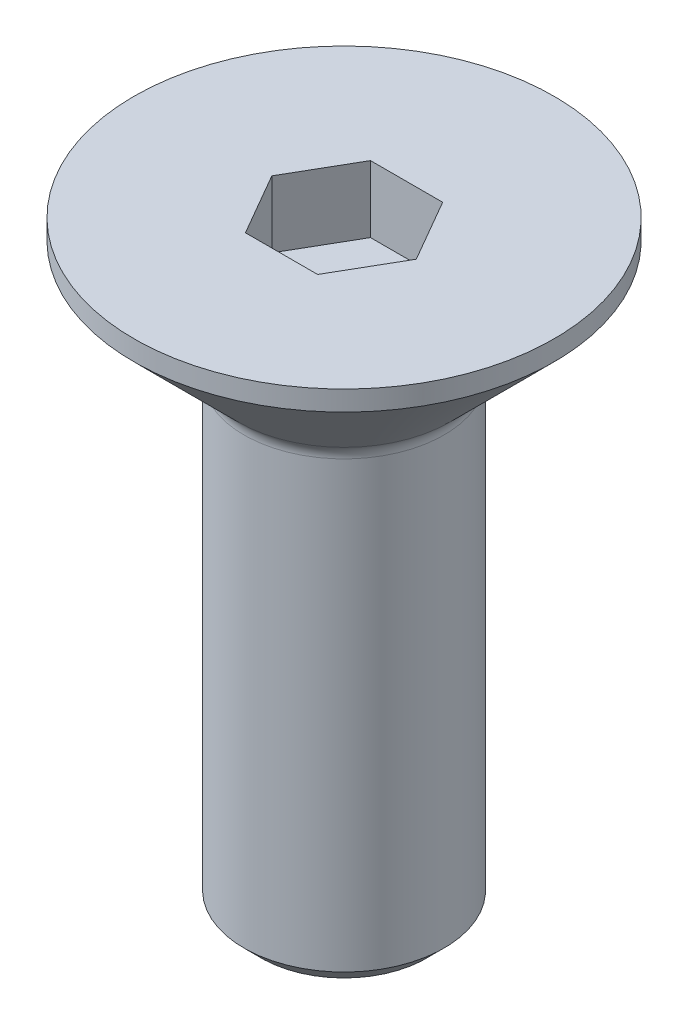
ISO-10303-21;
HEADER;
FILE_DESCRIPTION(('STEP AP214'),'2;1');
FILE_NAME('part.step','',(''),(''),'','','');
FILE_SCHEMA(('AUTOMOTIVE_DESIGN { 1 0 10303 214 1 1 1 1 }'));
ENDSEC;
DATA;
#1=APPLICATION_CONTEXT('core data for automotive mechanical design processes');
#2=APPLICATION_PROTOCOL_DEFINITION('international standard','automotive_design',2000,#1);
#3=PRODUCT_CONTEXT('',#1,'mechanical');
#4=PRODUCT('Part','Part','',(#3));
#5=PRODUCT_RELATED_PRODUCT_CATEGORY('part','',(#4));
#6=PRODUCT_DEFINITION_FORMATION('','',#4);
#7=PRODUCT_DEFINITION_CONTEXT('part definition',#1,'design');
#8=PRODUCT_DEFINITION('design','',#6,#7);
#9=PRODUCT_DEFINITION_SHAPE('','',#8);
#10=(LENGTH_UNIT() NAMED_UNIT(*) SI_UNIT(.MILLI.,.METRE.));
#11=(NAMED_UNIT(*) PLANE_ANGLE_UNIT() SI_UNIT($,.RADIAN.));
#12=(NAMED_UNIT(*) SI_UNIT($,.STERADIAN.) SOLID_ANGLE_UNIT());
#13=UNCERTAINTY_MEASURE_WITH_UNIT(LENGTH_MEASURE(1.E-05),#10,'distance_accuracy_value','');
#14=(GEOMETRIC_REPRESENTATION_CONTEXT(3) GLOBAL_UNCERTAINTY_ASSIGNED_CONTEXT((#13)) GLOBAL_UNIT_ASSIGNED_CONTEXT((#10,
#11,#12)) REPRESENTATION_CONTEXT('',''));
#15=CARTESIAN_POINT('',(0.,0.,0.));
#16=DIRECTION('',(0.,0.,1.));
#17=DIRECTION('',(1.,0.,0.));
#18=AXIS2_PLACEMENT_3D('',#15,#16,#17);
#19=CARTESIAN_POINT('',(0.,-2.76568542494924,0.));
#20=DIRECTION('',(0.,1.,0.));
#21=DIRECTION('',(-1.,0.,0.));
#22=AXIS2_PLACEMENT_3D('',#19,#20,#21);
#23=TOROIDAL_SURFACE('',#22,2.4,0.400000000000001);
#24=CARTESIAN_POINT('',(0.,-2.48284271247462,0.));
#25=DIRECTION('',(0.,1.,0.));
#26=DIRECTION('',(-1.,0.,0.));
#27=AXIS2_PLACEMENT_3D('',#24,#25,#26);
#28=CIRCLE('',#27,2.11715728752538);
#29=CARTESIAN_POINT('',(-2.11715728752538,-2.48284271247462,0.));
#30=VERTEX_POINT('',#29);
#31=EDGE_CURVE('E11',#30,#30,#28,.T.);
#32=ORIENTED_EDGE('',*,*,#31,.F.);
#33=EDGE_LOOP('',(#32));
#34=FACE_BOUND('',#33,.T.);
#35=CARTESIAN_POINT('',(0.,-2.76568542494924,0.));
#36=DIRECTION('',(0.,1.,0.));
#37=DIRECTION('',(-1.,0.,0.));
#38=AXIS2_PLACEMENT_3D('',#35,#36,#37);
#39=CIRCLE('',#38,2.);
#40=CARTESIAN_POINT('',(-2.,-2.76568542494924,0.));
#41=VERTEX_POINT('',#40);
#42=EDGE_CURVE('E135',#41,#41,#39,.T.);
#43=ORIENTED_EDGE('',*,*,#42,.T.);
#44=EDGE_LOOP('',(#43));
#45=FACE_BOUND('',#44,.T.);
#46=ADVANCED_FACE('F34',(#34,#45),#23,.F.);
#47=CARTESIAN_POINT('',(0.,-2.48284271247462,0.));
#48=DIRECTION('',(0.,1.,0.));
#49=DIRECTION('',(-1.,0.,0.));
#50=AXIS2_PLACEMENT_3D('',#47,#48,#49);
#51=CONICAL_SURFACE('',#50,2.11715728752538,0.78539816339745);
#52=CARTESIAN_POINT('',(0.,-0.400000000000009,0.));
#53=DIRECTION('',(0.,1.,0.));
#54=DIRECTION('',(-1.,0.,0.));
#55=AXIS2_PLACEMENT_3D('',#52,#53,#54);
#56=CIRCLE('',#55,4.2);
#57=CARTESIAN_POINT('',(-4.2,-0.400000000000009,0.));
#58=VERTEX_POINT('',#57);
#59=EDGE_CURVE('E41',#58,#58,#56,.T.);
#60=ORIENTED_EDGE('',*,*,#59,.F.);
#61=EDGE_LOOP('',(#60));
#62=FACE_BOUND('',#61,.T.);
#63=ORIENTED_EDGE('',*,*,#31,.T.);
#64=EDGE_LOOP('',(#63));
#65=FACE_BOUND('',#64,.T.);
#66=ADVANCED_FACE('F156',(#62,#65),#51,.T.);
#67=CARTESIAN_POINT('',(0.,0.,0.));
#68=DIRECTION('',(0.,1.,0.));
#69=DIRECTION('',(-1.,0.,0.));
#70=AXIS2_PLACEMENT_3D('',#67,#68,#69);
#71=CYLINDRICAL_SURFACE('',#70,4.2);
#72=CARTESIAN_POINT('',(0.,0.,0.));
#73=DIRECTION('',(0.,1.,0.));
#74=DIRECTION('',(-1.,0.,0.));
#75=AXIS2_PLACEMENT_3D('',#72,#73,#74);
#76=CIRCLE('',#75,4.2);
#77=CARTESIAN_POINT('',(-4.2,0.,0.));
#78=VERTEX_POINT('',#77);
#79=EDGE_CURVE('E149',#78,#78,#76,.T.);
#80=ORIENTED_EDGE('',*,*,#79,.F.);
#81=EDGE_LOOP('',(#80));
#82=FACE_BOUND('',#81,.T.);
#83=ORIENTED_EDGE('',*,*,#59,.T.);
#84=EDGE_LOOP('',(#83));
#85=FACE_BOUND('',#84,.T.);
#86=ADVANCED_FACE('F154',(#82,#85),#71,.T.);
#87=CARTESIAN_POINT('',(4.2,0.,0.));
#88=DIRECTION('',(0.,-1.,0.));
#89=DIRECTION('',(1.,0.,0.));
#90=AXIS2_PLACEMENT_3D('',#87,#88,#89);
#91=PLANE('',#90);
#92=DIRECTION('',(-0.5,0.,-0.866025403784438));
#93=VECTOR('',#92,1.);
#94=CARTESIAN_POINT('',(1.44337567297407,0.,0.));
#95=LINE('',#94,#93);
#96=CARTESIAN_POINT('',(1.44337567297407,0.,0.));
#97=VERTEX_POINT('',#96);
#98=CARTESIAN_POINT('',(0.721687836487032,0.,-1.25));
#99=VERTEX_POINT('',#98);
#100=EDGE_CURVE('E122',#97,#99,#95,.T.);
#101=ORIENTED_EDGE('',*,*,#100,.F.);
#102=DIRECTION('',(0.5,0.,-0.866025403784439));
#103=VECTOR('',#102,1.);
#104=CARTESIAN_POINT('',(0.721687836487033,0.,1.25));
#105=LINE('',#104,#103);
#106=CARTESIAN_POINT('',(0.721687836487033,0.,1.25));
#107=VERTEX_POINT('',#106);
#108=EDGE_CURVE('E48',#107,#97,#105,.T.);
#109=ORIENTED_EDGE('',*,*,#108,.F.);
#110=DIRECTION('',(1.,0.,0.));
#111=VECTOR('',#110,1.);
#112=CARTESIAN_POINT('',(-0.721687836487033,0.,1.25));
#113=LINE('',#112,#111);
#114=CARTESIAN_POINT('',(-0.721687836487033,0.,1.25));
#115=VERTEX_POINT('',#114);
#116=EDGE_CURVE('E131',#115,#107,#113,.T.);
#117=ORIENTED_EDGE('',*,*,#116,.F.);
#118=DIRECTION('',(0.5,0.,0.866025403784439));
#119=VECTOR('',#118,1.);
#120=CARTESIAN_POINT('',(-1.44337567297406,0.,0.));
#121=LINE('',#120,#119);
#122=CARTESIAN_POINT('',(-1.44337567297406,0.,0.));
#123=VERTEX_POINT('',#122);
#124=EDGE_CURVE('E129',#123,#115,#121,.T.);
#125=ORIENTED_EDGE('',*,*,#124,.F.);
#126=DIRECTION('',(-0.5,0.,0.866025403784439));
#127=VECTOR('',#126,1.);
#128=CARTESIAN_POINT('',(-0.721687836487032,0.,-1.25));
#129=LINE('',#128,#127);
#130=CARTESIAN_POINT('',(-0.721687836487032,0.,-1.25));
#131=VERTEX_POINT('',#130);
#132=EDGE_CURVE('E96',#131,#123,#129,.T.);
#133=ORIENTED_EDGE('',*,*,#132,.F.);
#134=DIRECTION('',(-1.,0.,0.));
#135=VECTOR('',#134,1.);
#136=CARTESIAN_POINT('',(0.721687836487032,0.,-1.25));
#137=LINE('',#136,#135);
#138=EDGE_CURVE('E125',#99,#131,#137,.T.);
#139=ORIENTED_EDGE('',*,*,#138,.F.);
#140=EDGE_LOOP('',(#101,#109,#117,#125,#133,#139));
#141=FACE_BOUND('',#140,.T.);
#142=ORIENTED_EDGE('',*,*,#79,.T.);
#143=EDGE_LOOP('',(#142));
#144=FACE_BOUND('',#143,.T.);
#145=ADVANCED_FACE('F180',(#141,#144),#91,.F.);
#146=CARTESIAN_POINT('',(1.65,-12.,0.));
#147=DIRECTION('',(0.,1.,0.));
#148=DIRECTION('',(-1.,0.,0.));
#149=AXIS2_PLACEMENT_3D('',#146,#147,#148);
#150=PLANE('',#149);
#151=CARTESIAN_POINT('',(0.,-12.,0.));
#152=DIRECTION('',(0.,1.,0.));
#153=DIRECTION('',(-1.,0.,0.));
#154=AXIS2_PLACEMENT_3D('',#151,#152,#153);
#155=CIRCLE('',#154,1.65);
#156=CARTESIAN_POINT('',(-1.65,-12.,0.));
#157=VERTEX_POINT('',#156);
#158=EDGE_CURVE('E146',#157,#157,#155,.T.);
#159=ORIENTED_EDGE('',*,*,#158,.F.);
#160=EDGE_LOOP('',(#159));
#161=FACE_BOUND('',#160,.T.);
#162=ADVANCED_FACE('F175',(#161),#150,.F.);
#163=CARTESIAN_POINT('',(0.,-12.,0.));
#164=DIRECTION('',(0.,1.,0.));
#165=DIRECTION('',(-1.,0.,0.));
#166=AXIS2_PLACEMENT_3D('',#163,#164,#165);
#167=CONICAL_SURFACE('',#166,1.65,0.785398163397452);
#168=CARTESIAN_POINT('',(0.,-11.65,0.));
#169=DIRECTION('',(0.,1.,0.));
#170=DIRECTION('',(-1.,0.,0.));
#171=AXIS2_PLACEMENT_3D('',#168,#169,#170);
#172=CIRCLE('',#171,2.);
#173=CARTESIAN_POINT('',(-2.,-11.65,0.));
#174=VERTEX_POINT('',#173);
#175=EDGE_CURVE('E143',#174,#174,#172,.T.);
#176=ORIENTED_EDGE('',*,*,#175,.F.);
#177=EDGE_LOOP('',(#176));
#178=FACE_BOUND('',#177,.T.);
#179=ORIENTED_EDGE('',*,*,#158,.T.);
#180=EDGE_LOOP('',(#179));
#181=FACE_BOUND('',#180,.T.);
#182=ADVANCED_FACE('F169',(#178,#181),#167,.T.);
#183=CARTESIAN_POINT('',(0.,0.,0.));
#184=DIRECTION('',(0.,1.,0.));
#185=DIRECTION('',(-1.,0.,0.));
#186=AXIS2_PLACEMENT_3D('',#183,#184,#185);
#187=CYLINDRICAL_SURFACE('',#186,2.);
#188=ORIENTED_EDGE('',*,*,#42,.F.);
#189=EDGE_LOOP('',(#188));
#190=FACE_BOUND('',#189,.T.);
#191=ORIENTED_EDGE('',*,*,#175,.T.);
#192=EDGE_LOOP('',(#191));
#193=FACE_BOUND('',#192,.T.);
#194=ADVANCED_FACE('F165',(#190,#193),#187,.T.);
#195=CARTESIAN_POINT('',(0.721687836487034,-1.33333333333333,1.25));
#196=DIRECTION('',(0.866025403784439,0.,0.5));
#197=DIRECTION('',(0.5,0.,-0.866025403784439));
#198=AXIS2_PLACEMENT_3D('',#195,#196,#197);
#199=PLANE('',#198);
#200=ORIENTED_EDGE('',*,*,#108,.T.);
#201=DIRECTION('',(0.,1.,0.));
#202=VECTOR('',#201,1.);
#203=CARTESIAN_POINT('',(1.44337567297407,-1.33333333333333,0.));
#204=LINE('',#203,#202);
#205=CARTESIAN_POINT('',(1.44337567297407,-1.33333333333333,0.));
#206=VERTEX_POINT('',#205);
#207=EDGE_CURVE('E78',#206,#97,#204,.T.);
#208=ORIENTED_EDGE('',*,*,#207,.F.);
#209=DIRECTION('',(0.5,0.,-0.866025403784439));
#210=VECTOR('',#209,1.);
#211=CARTESIAN_POINT('',(0.721687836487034,-1.33333333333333,1.25));
#212=LINE('',#211,#210);
#213=CARTESIAN_POINT('',(0.721687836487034,-1.33333333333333,1.25));
#214=VERTEX_POINT('',#213);
#215=EDGE_CURVE('E133',#214,#206,#212,.T.);
#216=ORIENTED_EDGE('',*,*,#215,.F.);
#217=DIRECTION('',(0.,1.,0.));
#218=VECTOR('',#217,1.);
#219=CARTESIAN_POINT('',(0.721687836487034,-1.33333333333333,1.25));
#220=LINE('',#219,#218);
#221=EDGE_CURVE('E56',#214,#107,#220,.T.);
#222=ORIENTED_EDGE('',*,*,#221,.T.);
#223=EDGE_LOOP('',(#200,#208,#216,#222));
#224=FACE_BOUND('',#223,.T.);
#225=ADVANCED_FACE('F168',(#224),#199,.F.);
#226=CARTESIAN_POINT('',(-0.721687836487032,-1.33333333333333,1.25));
#227=DIRECTION('',(0.,0.,1.));
#228=DIRECTION('',(1.,0.,0.));
#229=AXIS2_PLACEMENT_3D('',#226,#227,#228);
#230=PLANE('',#229);
#231=ORIENTED_EDGE('',*,*,#116,.T.);
#232=ORIENTED_EDGE('',*,*,#221,.F.);
#233=DIRECTION('',(1.,0.,0.));
#234=VECTOR('',#233,1.);
#235=CARTESIAN_POINT('',(-0.721687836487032,-1.33333333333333,1.25));
#236=LINE('',#235,#234);
#237=CARTESIAN_POINT('',(-0.721687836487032,-1.33333333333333,1.25));
#238=VERTEX_POINT('',#237);
#239=EDGE_CURVE('E108',#238,#214,#236,.T.);
#240=ORIENTED_EDGE('',*,*,#239,.F.);
#241=DIRECTION('',(0.,1.,0.));
#242=VECTOR('',#241,1.);
#243=CARTESIAN_POINT('',(-0.721687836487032,-1.33333333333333,1.25));
#244=LINE('',#243,#242);
#245=EDGE_CURVE('E100',#238,#115,#244,.T.);
#246=ORIENTED_EDGE('',*,*,#245,.T.);
#247=EDGE_LOOP('',(#231,#232,#240,#246));
#248=FACE_BOUND('',#247,.T.);
#249=ADVANCED_FACE('F215',(#248),#230,.F.);
#250=CARTESIAN_POINT('',(-1.44337567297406,-1.33333333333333,0.));
#251=DIRECTION('',(-0.866025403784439,0.,0.5));
#252=DIRECTION('',(0.5,0.,0.866025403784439));
#253=AXIS2_PLACEMENT_3D('',#250,#251,#252);
#254=PLANE('',#253);
#255=ORIENTED_EDGE('',*,*,#124,.T.);
#256=ORIENTED_EDGE('',*,*,#245,.F.);
#257=DIRECTION('',(0.5,0.,0.866025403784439));
#258=VECTOR('',#257,1.);
#259=CARTESIAN_POINT('',(-1.44337567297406,-1.33333333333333,0.));
#260=LINE('',#259,#258);
#261=CARTESIAN_POINT('',(-1.44337567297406,-1.33333333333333,0.));
#262=VERTEX_POINT('',#261);
#263=EDGE_CURVE('E104',#262,#238,#260,.T.);
#264=ORIENTED_EDGE('',*,*,#263,.F.);
#265=DIRECTION('',(0.,1.,0.));
#266=VECTOR('',#265,1.);
#267=CARTESIAN_POINT('',(-1.44337567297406,-1.33333333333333,0.));
#268=LINE('',#267,#266);
#269=EDGE_CURVE('E89',#262,#123,#268,.T.);
#270=ORIENTED_EDGE('',*,*,#269,.T.);
#271=EDGE_LOOP('',(#255,#256,#264,#270));
#272=FACE_BOUND('',#271,.T.);
#273=ADVANCED_FACE('F105',(#272),#254,.F.);
#274=CARTESIAN_POINT('',(-0.721687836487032,-1.33333333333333,-1.25));
#275=DIRECTION('',(-0.866025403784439,0.,-0.5));
#276=DIRECTION('',(-0.5,0.,0.866025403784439));
#277=AXIS2_PLACEMENT_3D('',#274,#275,#276);
#278=PLANE('',#277);
#279=ORIENTED_EDGE('',*,*,#132,.T.);
#280=ORIENTED_EDGE('',*,*,#269,.F.);
#281=DIRECTION('',(-0.5,0.,0.866025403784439));
#282=VECTOR('',#281,1.);
#283=CARTESIAN_POINT('',(-0.721687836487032,-1.33333333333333,-1.25));
#284=LINE('',#283,#282);
#285=CARTESIAN_POINT('',(-0.721687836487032,-1.33333333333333,-1.25));
#286=VERTEX_POINT('',#285);
#287=EDGE_CURVE('E93',#286,#262,#284,.T.);
#288=ORIENTED_EDGE('',*,*,#287,.F.);
#289=DIRECTION('',(0.,1.,0.));
#290=VECTOR('',#289,1.);
#291=CARTESIAN_POINT('',(-0.721687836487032,-1.33333333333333,-1.25));
#292=LINE('',#291,#290);
#293=EDGE_CURVE('E101',#286,#131,#292,.T.);
#294=ORIENTED_EDGE('',*,*,#293,.T.);
#295=EDGE_LOOP('',(#279,#280,#288,#294));
#296=FACE_BOUND('',#295,.T.);
#297=ADVANCED_FACE('F91',(#296),#278,.F.);
#298=CARTESIAN_POINT('',(0.721687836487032,-1.33333333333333,-1.25));
#299=DIRECTION('',(0.,0.,-1.));
#300=DIRECTION('',(-1.,0.,0.));
#301=AXIS2_PLACEMENT_3D('',#298,#299,#300);
#302=PLANE('',#301);
#303=ORIENTED_EDGE('',*,*,#138,.T.);
#304=ORIENTED_EDGE('',*,*,#293,.F.);
#305=DIRECTION('',(-1.,0.,0.));
#306=VECTOR('',#305,1.);
#307=CARTESIAN_POINT('',(0.721687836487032,-1.33333333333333,-1.25));
#308=LINE('',#307,#306);
#309=CARTESIAN_POINT('',(0.721687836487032,-1.33333333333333,-1.25));
#310=VERTEX_POINT('',#309);
#311=EDGE_CURVE('E114',#310,#286,#308,.T.);
#312=ORIENTED_EDGE('',*,*,#311,.F.);
#313=DIRECTION('',(0.,1.,0.));
#314=VECTOR('',#313,1.);
#315=CARTESIAN_POINT('',(0.721687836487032,-1.33333333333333,-1.25));
#316=LINE('',#315,#314);
#317=EDGE_CURVE('E138',#310,#99,#316,.T.);
#318=ORIENTED_EDGE('',*,*,#317,.T.);
#319=EDGE_LOOP('',(#303,#304,#312,#318));
#320=FACE_BOUND('',#319,.T.);
#321=ADVANCED_FACE('F240',(#320),#302,.F.);
#322=CARTESIAN_POINT('',(1.44337567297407,-1.33333333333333,0.));
#323=DIRECTION('',(0.866025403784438,0.,-0.5));
#324=DIRECTION('',(-0.5,0.,-0.866025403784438));
#325=AXIS2_PLACEMENT_3D('',#322,#323,#324);
#326=PLANE('',#325);
#327=ORIENTED_EDGE('',*,*,#100,.T.);
#328=ORIENTED_EDGE('',*,*,#317,.F.);
#329=DIRECTION('',(-0.5,0.,-0.866025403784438));
#330=VECTOR('',#329,1.);
#331=CARTESIAN_POINT('',(1.44337567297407,-1.33333333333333,0.));
#332=LINE('',#331,#330);
#333=EDGE_CURVE('E116',#206,#310,#332,.T.);
#334=ORIENTED_EDGE('',*,*,#333,.F.);
#335=ORIENTED_EDGE('',*,*,#207,.T.);
#336=EDGE_LOOP('',(#327,#328,#334,#335));
#337=FACE_BOUND('',#336,.T.);
#338=ADVANCED_FACE('F249',(#337),#326,.F.);
#339=CARTESIAN_POINT('',(1.44337567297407,-1.33333333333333,0.));
#340=DIRECTION('',(0.,1.,0.));
#341=DIRECTION('',(-1.,0.,0.));
#342=AXIS2_PLACEMENT_3D('',#339,#340,#341);
#343=PLANE('',#342);
#344=ORIENTED_EDGE('',*,*,#215,.T.);
#345=ORIENTED_EDGE('',*,*,#333,.T.);
#346=ORIENTED_EDGE('',*,*,#311,.T.);
#347=ORIENTED_EDGE('',*,*,#287,.T.);
#348=ORIENTED_EDGE('',*,*,#263,.T.);
#349=ORIENTED_EDGE('',*,*,#239,.T.);
#350=EDGE_LOOP('',(#344,#345,#346,#347,#348,#349));
#351=FACE_BOUND('',#350,.T.);
#352=ADVANCED_FACE('F111',(#351),#343,.T.);
#353=CLOSED_SHELL('',(#46,#66,#86,#145,#162,#182,#194,#225,#249,#273,#297,#321,#338,#352));
#354=MANIFOLD_SOLID_BREP('B2',#353);
#355=ADVANCED_BREP_SHAPE_REPRESENTATION('',(#18,#354),#14);
#356=SHAPE_DEFINITION_REPRESENTATION(#9,#355);
ENDSEC;
END-ISO-10303-21;
